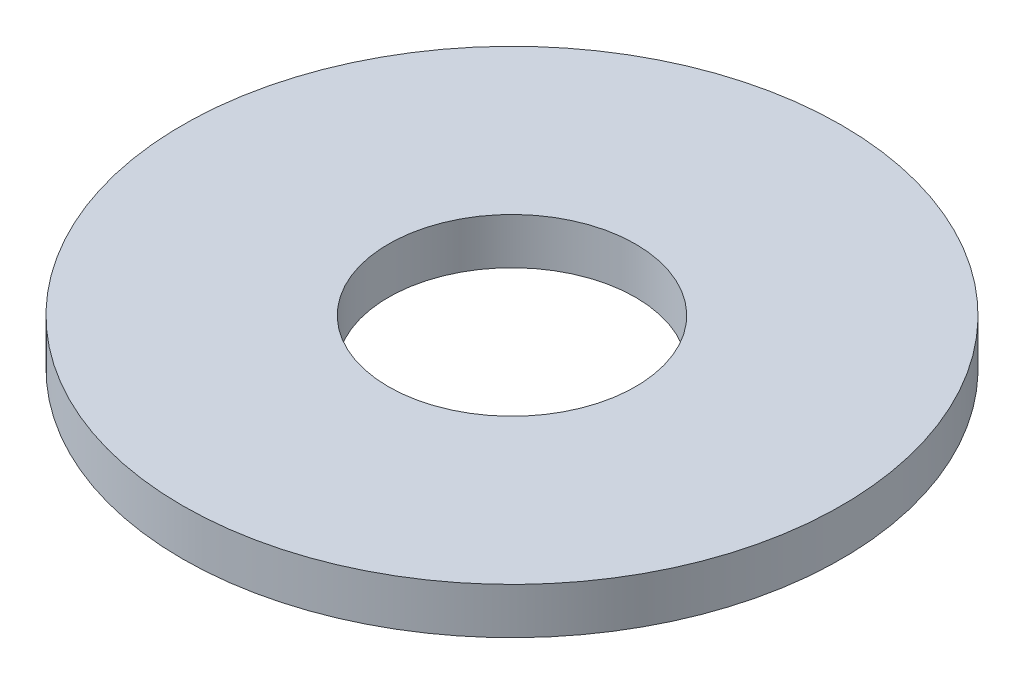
ISO-10303-21;
HEADER;
FILE_DESCRIPTION(('STEP AP214'),'2;1');
FILE_NAME('part.step','',(''),(''),'','','');
FILE_SCHEMA(('AUTOMOTIVE_DESIGN { 1 0 10303 214 1 1 1 1 }'));
ENDSEC;
DATA;
#1=APPLICATION_CONTEXT('core data for automotive mechanical design processes');
#2=APPLICATION_PROTOCOL_DEFINITION('international standard','automotive_design',2000,#1);
#3=PRODUCT_CONTEXT('',#1,'mechanical');
#4=PRODUCT('Part','Part','',(#3));
#5=PRODUCT_RELATED_PRODUCT_CATEGORY('part','',(#4));
#6=PRODUCT_DEFINITION_FORMATION('','',#4);
#7=PRODUCT_DEFINITION_CONTEXT('part definition',#1,'design');
#8=PRODUCT_DEFINITION('design','',#6,#7);
#9=PRODUCT_DEFINITION_SHAPE('','',#8);
#10=(LENGTH_UNIT() NAMED_UNIT(*) SI_UNIT(.MILLI.,.METRE.));
#11=(NAMED_UNIT(*) PLANE_ANGLE_UNIT() SI_UNIT($,.RADIAN.));
#12=(NAMED_UNIT(*) SI_UNIT($,.STERADIAN.) SOLID_ANGLE_UNIT());
#13=UNCERTAINTY_MEASURE_WITH_UNIT(LENGTH_MEASURE(1.E-05),#10,'distance_accuracy_value','');
#14=(GEOMETRIC_REPRESENTATION_CONTEXT(3) GLOBAL_UNCERTAINTY_ASSIGNED_CONTEXT((#13)) GLOBAL_UNIT_ASSIGNED_CONTEXT((#10,
#11,#12)) REPRESENTATION_CONTEXT('',''));
#15=CARTESIAN_POINT('',(0.,0.,0.));
#16=DIRECTION('',(0.,0.,1.));
#17=DIRECTION('',(1.,0.,0.));
#18=AXIS2_PLACEMENT_3D('',#15,#16,#17);
#19=CARTESIAN_POINT('',(0.,1.778,0.));
#20=DIRECTION('',(0.,1.,0.));
#21=DIRECTION('',(0.,0.,1.));
#22=AXIS2_PLACEMENT_3D('',#19,#20,#21);
#23=PLANE('',#22);
#24=CARTESIAN_POINT('',(0.,1.778,0.));
#25=DIRECTION('',(0.,1.,0.));
#26=DIRECTION('',(0.,0.,1.));
#27=AXIS2_PLACEMENT_3D('',#24,#25,#26);
#28=CIRCLE('',#27,12.7);
#29=CARTESIAN_POINT('',(0.,1.778,12.7));
#30=VERTEX_POINT('',#29);
#31=EDGE_CURVE('E10',#30,#30,#28,.T.);
#32=ORIENTED_EDGE('',*,*,#31,.T.);
#33=EDGE_LOOP('',(#32));
#34=FACE_BOUND('',#33,.T.);
#35=CARTESIAN_POINT('',(0.,1.778,0.));
#36=DIRECTION('',(0.,1.,0.));
#37=DIRECTION('',(0.,0.,1.));
#38=AXIS2_PLACEMENT_3D('',#35,#36,#37);
#39=CIRCLE('',#38,4.7625);
#40=CARTESIAN_POINT('',(0.,1.778,4.7625));
#41=VERTEX_POINT('',#40);
#42=EDGE_CURVE('E41',#41,#41,#39,.T.);
#43=ORIENTED_EDGE('',*,*,#42,.F.);
#44=EDGE_LOOP('',(#43));
#45=FACE_BOUND('',#44,.T.);
#46=ADVANCED_FACE('F30',(#34,#45),#23,.T.);
#47=CARTESIAN_POINT('',(0.,0.,0.));
#48=DIRECTION('',(0.,1.,0.));
#49=DIRECTION('',(0.,0.,1.));
#50=AXIS2_PLACEMENT_3D('',#47,#48,#49);
#51=PLANE('',#50);
#52=CARTESIAN_POINT('',(0.,0.,0.));
#53=DIRECTION('',(0.,1.,0.));
#54=DIRECTION('',(0.,0.,1.));
#55=AXIS2_PLACEMENT_3D('',#52,#53,#54);
#56=CIRCLE('',#55,12.7);
#57=CARTESIAN_POINT('',(0.,0.,12.7));
#58=VERTEX_POINT('',#57);
#59=EDGE_CURVE('E37',#58,#58,#56,.T.);
#60=ORIENTED_EDGE('',*,*,#59,.F.);
#61=EDGE_LOOP('',(#60));
#62=FACE_BOUND('',#61,.T.);
#63=CARTESIAN_POINT('',(0.,0.,0.));
#64=DIRECTION('',(0.,1.,0.));
#65=DIRECTION('',(0.,0.,1.));
#66=AXIS2_PLACEMENT_3D('',#63,#64,#65);
#67=CIRCLE('',#66,4.7625);
#68=CARTESIAN_POINT('',(0.,0.,4.7625));
#69=VERTEX_POINT('',#68);
#70=EDGE_CURVE('E45',#69,#69,#67,.T.);
#71=ORIENTED_EDGE('',*,*,#70,.T.);
#72=EDGE_LOOP('',(#71));
#73=FACE_BOUND('',#72,.T.);
#74=ADVANCED_FACE('F51',(#62,#73),#51,.F.);
#75=CARTESIAN_POINT('',(0.,1.778,0.));
#76=DIRECTION('',(0.,-1.,0.));
#77=DIRECTION('',(0.,0.,-1.));
#78=AXIS2_PLACEMENT_3D('',#75,#76,#77);
#79=CYLINDRICAL_SURFACE('',#78,12.7);
#80=ORIENTED_EDGE('',*,*,#31,.F.);
#81=EDGE_LOOP('',(#80));
#82=FACE_BOUND('',#81,.T.);
#83=ORIENTED_EDGE('',*,*,#59,.T.);
#84=EDGE_LOOP('',(#83));
#85=FACE_BOUND('',#84,.T.);
#86=ADVANCED_FACE('F32',(#82,#85),#79,.T.);
#87=CARTESIAN_POINT('',(0.,1.778,0.));
#88=DIRECTION('',(0.,-1.,0.));
#89=DIRECTION('',(0.,0.,-1.));
#90=AXIS2_PLACEMENT_3D('',#87,#88,#89);
#91=CYLINDRICAL_SURFACE('',#90,4.7625);
#92=ORIENTED_EDGE('',*,*,#42,.T.);
#93=EDGE_LOOP('',(#92));
#94=FACE_BOUND('',#93,.T.);
#95=ORIENTED_EDGE('',*,*,#70,.F.);
#96=EDGE_LOOP('',(#95));
#97=FACE_BOUND('',#96,.T.);
#98=ADVANCED_FACE('F53',(#94,#97),#91,.F.);
#99=CLOSED_SHELL('',(#46,#74,#86,#98));
#100=MANIFOLD_SOLID_BREP('B2',#99);
#101=ADVANCED_BREP_SHAPE_REPRESENTATION('',(#18,#100),#14);
#102=SHAPE_DEFINITION_REPRESENTATION(#9,#101);
ENDSEC;
END-ISO-10303-21;
